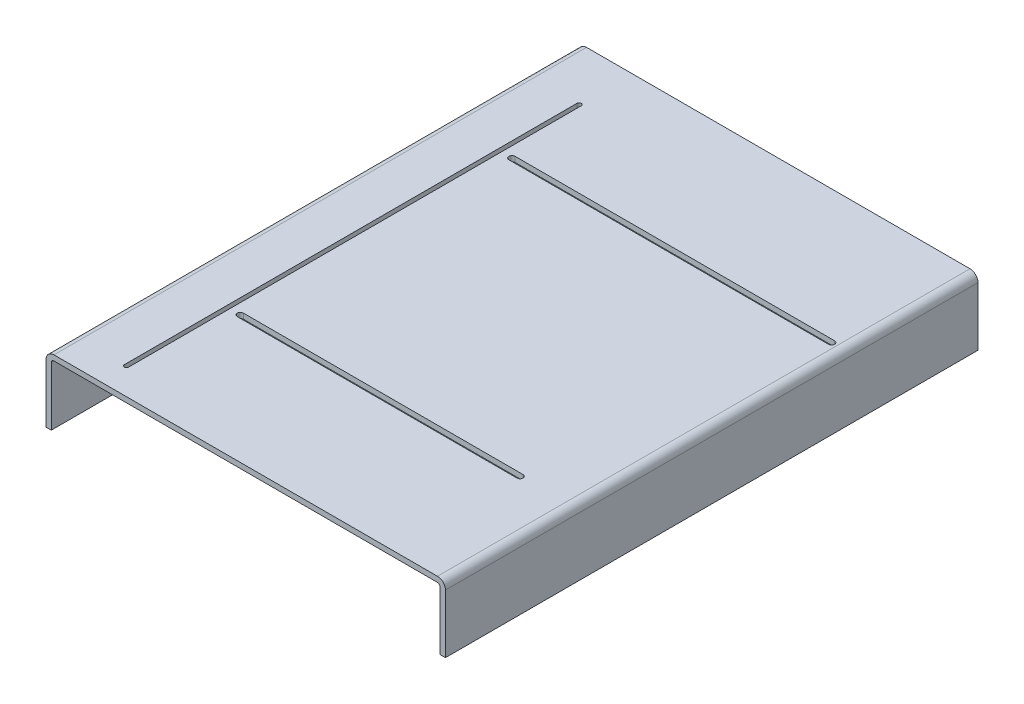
ISO-10303-21;
HEADER;
FILE_DESCRIPTION(('STEP AP214'),'2;1');
FILE_NAME('part.step','',(''),(''),'','','');
FILE_SCHEMA(('AUTOMOTIVE_DESIGN { 1 0 10303 214 1 1 1 1 }'));
ENDSEC;
DATA;
#1=APPLICATION_CONTEXT('core data for automotive mechanical design processes');
#2=APPLICATION_PROTOCOL_DEFINITION('international standard','automotive_design',2000,#1);
#3=PRODUCT_CONTEXT('',#1,'mechanical');
#4=PRODUCT('Part','Part','',(#3));
#5=PRODUCT_RELATED_PRODUCT_CATEGORY('part','',(#4));
#6=PRODUCT_DEFINITION_FORMATION('','',#4);
#7=PRODUCT_DEFINITION_CONTEXT('part definition',#1,'design');
#8=PRODUCT_DEFINITION('design','',#6,#7);
#9=PRODUCT_DEFINITION_SHAPE('','',#8);
#10=(LENGTH_UNIT() NAMED_UNIT(*) SI_UNIT(.MILLI.,.METRE.));
#11=(NAMED_UNIT(*) PLANE_ANGLE_UNIT() SI_UNIT($,.RADIAN.));
#12=(NAMED_UNIT(*) SI_UNIT($,.STERADIAN.) SOLID_ANGLE_UNIT());
#13=UNCERTAINTY_MEASURE_WITH_UNIT(LENGTH_MEASURE(1.E-05),#10,'distance_accuracy_value','');
#14=(GEOMETRIC_REPRESENTATION_CONTEXT(3) GLOBAL_UNCERTAINTY_ASSIGNED_CONTEXT((#13)) GLOBAL_UNIT_ASSIGNED_CONTEXT((#10,
#11,#12)) REPRESENTATION_CONTEXT('',''));
#15=CARTESIAN_POINT('',(0.,0.,0.));
#16=DIRECTION('',(0.,0.,1.));
#17=DIRECTION('',(1.,0.,0.));
#18=AXIS2_PLACEMENT_3D('',#15,#16,#17);
#19=CARTESIAN_POINT('',(10.,0.,1000.));
#20=DIRECTION('',(0.,1.,0.));
#21=DIRECTION('',(0.,0.,1.));
#22=AXIS2_PLACEMENT_3D('',#19,#20,#21);
#23=PLANE('',#22);
#24=DIRECTION('',(1.,0.,0.));
#25=VECTOR('',#24,1.);
#26=CARTESIAN_POINT('',(10.,0.,0.));
#27=LINE('',#26,#25);
#28=CARTESIAN_POINT('',(0.,0.,0.));
#29=VERTEX_POINT('',#28);
#30=CARTESIAN_POINT('',(10.,0.,0.));
#31=VERTEX_POINT('',#30);
#32=EDGE_CURVE('E288',#29,#31,#27,.T.);
#33=ORIENTED_EDGE('',*,*,#32,.T.);
#34=DIRECTION('',(0.,0.,-1.));
#35=VECTOR('',#34,1.);
#36=CARTESIAN_POINT('',(10.,0.,1000.));
#37=LINE('',#36,#35);
#38=CARTESIAN_POINT('',(10.,0.,1000.));
#39=VERTEX_POINT('',#38);
#40=EDGE_CURVE('E339',#39,#31,#37,.T.);
#41=ORIENTED_EDGE('',*,*,#40,.F.);
#42=DIRECTION('',(1.,0.,0.));
#43=VECTOR('',#42,1.);
#44=CARTESIAN_POINT('',(10.,0.,1000.));
#45=LINE('',#44,#43);
#46=CARTESIAN_POINT('',(0.,0.,1000.));
#47=VERTEX_POINT('',#46);
#48=EDGE_CURVE('E289',#47,#39,#45,.T.);
#49=ORIENTED_EDGE('',*,*,#48,.F.);
#50=DIRECTION('',(0.,0.,-1.));
#51=VECTOR('',#50,1.);
#52=CARTESIAN_POINT('',(0.,0.,1000.));
#53=LINE('',#52,#51);
#54=EDGE_CURVE('E311',#47,#29,#53,.T.);
#55=ORIENTED_EDGE('',*,*,#54,.T.);
#56=EDGE_LOOP('',(#33,#41,#49,#55));
#57=FACE_BOUND('',#56,.T.);
#58=ADVANCED_FACE('F31',(#57),#23,.F.);
#59=CARTESIAN_POINT('',(10.,0.,1000.));
#60=DIRECTION('',(-1.,0.,0.));
#61=DIRECTION('',(0.,0.,1.));
#62=AXIS2_PLACEMENT_3D('',#59,#60,#61);
#63=PLANE('',#62);
#64=DIRECTION('',(0.,1.,0.));
#65=VECTOR('',#64,1.);
#66=CARTESIAN_POINT('',(10.,0.,0.));
#67=LINE('',#66,#65);
#68=CARTESIAN_POINT('',(10.,110.,0.));
#69=VERTEX_POINT('',#68);
#70=EDGE_CURVE('E314',#31,#69,#67,.T.);
#71=ORIENTED_EDGE('',*,*,#70,.T.);
#72=DIRECTION('',(0.,0.,-1.));
#73=VECTOR('',#72,1.);
#74=CARTESIAN_POINT('',(10.,110.,1000.));
#75=LINE('',#74,#73);
#76=CARTESIAN_POINT('',(10.,110.,1000.));
#77=VERTEX_POINT('',#76);
#78=EDGE_CURVE('E350',#69,#77,#75,.F.);
#79=ORIENTED_EDGE('',*,*,#78,.T.);
#80=DIRECTION('',(0.,1.,0.));
#81=VECTOR('',#80,1.);
#82=CARTESIAN_POINT('',(10.,0.,1000.));
#83=LINE('',#82,#81);
#84=EDGE_CURVE('E292',#39,#77,#83,.T.);
#85=ORIENTED_EDGE('',*,*,#84,.F.);
#86=ORIENTED_EDGE('',*,*,#40,.T.);
#87=EDGE_LOOP('',(#71,#79,#85,#86));
#88=FACE_BOUND('',#87,.T.);
#89=ADVANCED_FACE('F425',(#88),#63,.F.);
#90=CARTESIAN_POINT('',(10.,115.,1000.));
#91=DIRECTION('',(0.,1.,0.));
#92=DIRECTION('',(0.,0.,1.));
#93=AXIS2_PLACEMENT_3D('',#90,#91,#92);
#94=PLANE('',#93);
#95=DIRECTION('',(1.,0.,0.));
#96=VECTOR('',#95,1.);
#97=CARTESIAN_POINT('',(125.,115.,754.25));
#98=LINE('',#97,#96);
#99=CARTESIAN_POINT('',(125.,115.,754.25));
#100=VERTEX_POINT('',#99);
#101=CARTESIAN_POINT('',(650.,115.,754.25));
#102=VERTEX_POINT('',#101);
#103=EDGE_CURVE('E211',#100,#102,#98,.T.);
#104=ORIENTED_EDGE('',*,*,#103,.F.);
#105=CARTESIAN_POINT('',(125.,115.,760.));
#106=DIRECTION('',(0.,1.,0.));
#107=DIRECTION('',(0.,0.,1.));
#108=AXIS2_PLACEMENT_3D('',#105,#106,#107);
#109=CIRCLE('',#108,5.74999999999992);
#110=CARTESIAN_POINT('',(125.,115.,765.75));
#111=VERTEX_POINT('',#110);
#112=EDGE_CURVE('E193',#111,#100,#109,.F.);
#113=ORIENTED_EDGE('',*,*,#112,.F.);
#114=DIRECTION('',(-1.,0.,0.));
#115=VECTOR('',#114,1.);
#116=CARTESIAN_POINT('',(125.,115.,765.75));
#117=LINE('',#116,#115);
#118=CARTESIAN_POINT('',(650.,115.,765.75));
#119=VERTEX_POINT('',#118);
#120=EDGE_CURVE('E202',#119,#111,#117,.T.);
#121=ORIENTED_EDGE('',*,*,#120,.F.);
#122=CARTESIAN_POINT('',(650.,115.,760.));
#123=DIRECTION('',(0.,1.,0.));
#124=DIRECTION('',(0.,0.,1.));
#125=AXIS2_PLACEMENT_3D('',#122,#123,#124);
#126=CIRCLE('',#125,5.74999999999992);
#127=EDGE_CURVE('E46',#102,#119,#126,.F.);
#128=ORIENTED_EDGE('',*,*,#127,.F.);
#129=EDGE_LOOP('',(#104,#113,#121,#128));
#130=FACE_BOUND('',#129,.T.);
#131=DIRECTION('',(0.,0.,-1.));
#132=VECTOR('',#131,1.);
#133=CARTESIAN_POINT('',(105.,115.,1000.));
#134=LINE('',#133,#132);
#135=CARTESIAN_POINT('',(105.,115.,950.));
#136=VERTEX_POINT('',#135);
#137=CARTESIAN_POINT('',(105.,115.,100.));
#138=VERTEX_POINT('',#137);
#139=EDGE_CURVE('E253',#136,#138,#134,.T.);
#140=ORIENTED_EDGE('',*,*,#139,.T.);
#141=CARTESIAN_POINT('',(101.,115.,100.));
#142=DIRECTION('',(0.,1.,0.));
#143=DIRECTION('',(0.,0.,1.));
#144=AXIS2_PLACEMENT_3D('',#141,#142,#143);
#145=CIRCLE('',#144,3.99999999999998);
#146=CARTESIAN_POINT('',(97.,115.,100.));
#147=VERTEX_POINT('',#146);
#148=EDGE_CURVE('E256',#138,#147,#145,.T.);
#149=ORIENTED_EDGE('',*,*,#148,.T.);
#150=DIRECTION('',(0.,0.,1.));
#151=VECTOR('',#150,1.);
#152=CARTESIAN_POINT('',(97.0000000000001,115.,1000.));
#153=LINE('',#152,#151);
#154=CARTESIAN_POINT('',(97.0000000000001,115.,950.));
#155=VERTEX_POINT('',#154);
#156=EDGE_CURVE('E241',#147,#155,#153,.T.);
#157=ORIENTED_EDGE('',*,*,#156,.T.);
#158=CARTESIAN_POINT('',(101.,115.,950.));
#159=DIRECTION('',(0.,1.,0.));
#160=DIRECTION('',(0.,0.,1.));
#161=AXIS2_PLACEMENT_3D('',#158,#159,#160);
#162=CIRCLE('',#161,4.);
#163=EDGE_CURVE('E250',#155,#136,#162,.T.);
#164=ORIENTED_EDGE('',*,*,#163,.T.);
#165=EDGE_LOOP('',(#140,#149,#157,#164));
#166=FACE_BOUND('',#165,.T.);
#167=DIRECTION('',(1.,0.,0.));
#168=VECTOR('',#167,1.);
#169=CARTESIAN_POINT('',(125.,115.,244.25));
#170=LINE('',#169,#168);
#171=CARTESIAN_POINT('',(125.,115.,244.25));
#172=VERTEX_POINT('',#171);
#173=CARTESIAN_POINT('',(725.,115.,244.25));
#174=VERTEX_POINT('',#173);
#175=EDGE_CURVE('E263',#172,#174,#170,.T.);
#176=ORIENTED_EDGE('',*,*,#175,.F.);
#177=CARTESIAN_POINT('',(125.,115.,250.));
#178=DIRECTION('',(0.,1.,0.));
#179=DIRECTION('',(0.,0.,1.));
#180=AXIS2_PLACEMENT_3D('',#177,#178,#179);
#181=CIRCLE('',#180,5.75000000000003);
#182=CARTESIAN_POINT('',(125.,115.,255.75));
#183=VERTEX_POINT('',#182);
#184=EDGE_CURVE('E266',#183,#172,#181,.F.);
#185=ORIENTED_EDGE('',*,*,#184,.F.);
#186=DIRECTION('',(-1.,0.,0.));
#187=VECTOR('',#186,1.);
#188=CARTESIAN_POINT('',(125.,115.,255.75));
#189=LINE('',#188,#187);
#190=CARTESIAN_POINT('',(725.,115.,255.75));
#191=VERTEX_POINT('',#190);
#192=EDGE_CURVE('E268',#191,#183,#189,.T.);
#193=ORIENTED_EDGE('',*,*,#192,.F.);
#194=CARTESIAN_POINT('',(725.,115.,250.));
#195=DIRECTION('',(0.,1.,0.));
#196=DIRECTION('',(0.,0.,1.));
#197=AXIS2_PLACEMENT_3D('',#194,#195,#196);
#198=CIRCLE('',#197,5.74999999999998);
#199=EDGE_CURVE('E260',#174,#191,#198,.F.);
#200=ORIENTED_EDGE('',*,*,#199,.F.);
#201=EDGE_LOOP('',(#176,#185,#193,#200));
#202=FACE_BOUND('',#201,.T.);
#203=DIRECTION('',(1.,0.,0.));
#204=VECTOR('',#203,1.);
#205=CARTESIAN_POINT('',(10.,115.,0.));
#206=LINE('',#205,#204);
#207=CARTESIAN_POINT('',(15.,115.,0.));
#208=VERTEX_POINT('',#207);
#209=CARTESIAN_POINT('',(735.,115.,0.));
#210=VERTEX_POINT('',#209);
#211=EDGE_CURVE('E317',#208,#210,#206,.T.);
#212=ORIENTED_EDGE('',*,*,#211,.T.);
#213=DIRECTION('',(0.,0.,-1.));
#214=VECTOR('',#213,1.);
#215=CARTESIAN_POINT('',(735.,115.,1000.));
#216=LINE('',#215,#214);
#217=CARTESIAN_POINT('',(735.,115.,1000.));
#218=VERTEX_POINT('',#217);
#219=EDGE_CURVE('E348',#210,#218,#216,.F.);
#220=ORIENTED_EDGE('',*,*,#219,.T.);
#221=DIRECTION('',(1.,0.,0.));
#222=VECTOR('',#221,1.);
#223=CARTESIAN_POINT('',(10.,115.,1000.));
#224=LINE('',#223,#222);
#225=CARTESIAN_POINT('',(15.,115.,1000.));
#226=VERTEX_POINT('',#225);
#227=EDGE_CURVE('E296',#226,#218,#224,.T.);
#228=ORIENTED_EDGE('',*,*,#227,.F.);
#229=DIRECTION('',(0.,0.,-1.));
#230=VECTOR('',#229,1.);
#231=CARTESIAN_POINT('',(15.,115.,0.));
#232=LINE('',#231,#230);
#233=EDGE_CURVE('E345',#226,#208,#232,.T.);
#234=ORIENTED_EDGE('',*,*,#233,.T.);
#235=EDGE_LOOP('',(#212,#220,#228,#234));
#236=FACE_BOUND('',#235,.T.);
#237=ADVANCED_FACE('F208',(#130,#166,#202,#236),#94,.F.);
#238=CARTESIAN_POINT('',(740.,115.,1000.));
#239=DIRECTION('',(1.,0.,0.));
#240=DIRECTION('',(0.,0.,-1.));
#241=AXIS2_PLACEMENT_3D('',#238,#239,#240);
#242=PLANE('',#241);
#243=DIRECTION('',(0.,-1.,0.));
#244=VECTOR('',#243,1.);
#245=CARTESIAN_POINT('',(740.,115.,1000.));
#246=LINE('',#245,#244);
#247=CARTESIAN_POINT('',(740.,110.,1000.));
#248=VERTEX_POINT('',#247);
#249=CARTESIAN_POINT('',(740.,0.,1000.));
#250=VERTEX_POINT('',#249);
#251=EDGE_CURVE('E299',#248,#250,#246,.T.);
#252=ORIENTED_EDGE('',*,*,#251,.F.);
#253=DIRECTION('',(0.,0.,-1.));
#254=VECTOR('',#253,1.);
#255=CARTESIAN_POINT('',(740.,110.,0.));
#256=LINE('',#255,#254);
#257=CARTESIAN_POINT('',(740.,110.,0.));
#258=VERTEX_POINT('',#257);
#259=EDGE_CURVE('E342',#248,#258,#256,.T.);
#260=ORIENTED_EDGE('',*,*,#259,.T.);
#261=DIRECTION('',(0.,-1.,0.));
#262=VECTOR('',#261,1.);
#263=CARTESIAN_POINT('',(740.,115.,0.));
#264=LINE('',#263,#262);
#265=CARTESIAN_POINT('',(740.,0.,0.));
#266=VERTEX_POINT('',#265);
#267=EDGE_CURVE('E320',#258,#266,#264,.T.);
#268=ORIENTED_EDGE('',*,*,#267,.T.);
#269=DIRECTION('',(0.,0.,-1.));
#270=VECTOR('',#269,1.);
#271=CARTESIAN_POINT('',(740.,0.,1000.));
#272=LINE('',#271,#270);
#273=EDGE_CURVE('E336',#250,#266,#272,.T.);
#274=ORIENTED_EDGE('',*,*,#273,.F.);
#275=EDGE_LOOP('',(#252,#260,#268,#274));
#276=FACE_BOUND('',#275,.T.);
#277=ADVANCED_FACE('F411',(#276),#242,.F.);
#278=CARTESIAN_POINT('',(740.,0.,1000.));
#279=DIRECTION('',(0.,1.,0.));
#280=DIRECTION('',(0.,0.,1.));
#281=AXIS2_PLACEMENT_3D('',#278,#279,#280);
#282=PLANE('',#281);
#283=DIRECTION('',(1.,0.,0.));
#284=VECTOR('',#283,1.);
#285=CARTESIAN_POINT('',(740.,0.,0.));
#286=LINE('',#285,#284);
#287=CARTESIAN_POINT('',(750.,0.,0.));
#288=VERTEX_POINT('',#287);
#289=EDGE_CURVE('E322',#266,#288,#286,.T.);
#290=ORIENTED_EDGE('',*,*,#289,.T.);
#291=DIRECTION('',(0.,0.,-1.));
#292=VECTOR('',#291,1.);
#293=CARTESIAN_POINT('',(750.,0.,1000.));
#294=LINE('',#293,#292);
#295=CARTESIAN_POINT('',(750.,0.,1000.));
#296=VERTEX_POINT('',#295);
#297=EDGE_CURVE('E333',#296,#288,#294,.T.);
#298=ORIENTED_EDGE('',*,*,#297,.F.);
#299=DIRECTION('',(1.,0.,0.));
#300=VECTOR('',#299,1.);
#301=CARTESIAN_POINT('',(740.,0.,1000.));
#302=LINE('',#301,#300);
#303=EDGE_CURVE('E301',#250,#296,#302,.T.);
#304=ORIENTED_EDGE('',*,*,#303,.F.);
#305=ORIENTED_EDGE('',*,*,#273,.T.);
#306=EDGE_LOOP('',(#290,#298,#304,#305));
#307=FACE_BOUND('',#306,.T.);
#308=ADVANCED_FACE('F405',(#307),#282,.F.);
#309=CARTESIAN_POINT('',(750.,125.,1000.));
#310=DIRECTION('',(-1.,0.,0.));
#311=DIRECTION('',(0.,0.,1.));
#312=AXIS2_PLACEMENT_3D('',#309,#310,#311);
#313=PLANE('',#312);
#314=DIRECTION('',(0.,1.,0.));
#315=VECTOR('',#314,1.);
#316=CARTESIAN_POINT('',(750.,125.,0.));
#317=LINE('',#316,#315);
#318=CARTESIAN_POINT('',(750.,110.,0.));
#319=VERTEX_POINT('',#318);
#320=EDGE_CURVE('E324',#288,#319,#317,.T.);
#321=ORIENTED_EDGE('',*,*,#320,.T.);
#322=DIRECTION('',(0.,0.,-1.));
#323=VECTOR('',#322,1.);
#324=CARTESIAN_POINT('',(750.,110.,1000.));
#325=LINE('',#324,#323);
#326=CARTESIAN_POINT('',(750.,110.,1000.));
#327=VERTEX_POINT('',#326);
#328=EDGE_CURVE('E11',#319,#327,#325,.F.);
#329=ORIENTED_EDGE('',*,*,#328,.T.);
#330=DIRECTION('',(0.,1.,0.));
#331=VECTOR('',#330,1.);
#332=CARTESIAN_POINT('',(750.,125.,1000.));
#333=LINE('',#332,#331);
#334=EDGE_CURVE('E303',#296,#327,#333,.T.);
#335=ORIENTED_EDGE('',*,*,#334,.F.);
#336=ORIENTED_EDGE('',*,*,#297,.T.);
#337=EDGE_LOOP('',(#321,#329,#335,#336));
#338=FACE_BOUND('',#337,.T.);
#339=ADVANCED_FACE('F400',(#338),#313,.F.);
#340=CARTESIAN_POINT('',(0.,125.,1000.));
#341=DIRECTION('',(0.,-1.,0.));
#342=DIRECTION('',(0.,0.,-1.));
#343=AXIS2_PLACEMENT_3D('',#340,#341,#342);
#344=PLANE('',#343);
#345=DIRECTION('',(1.,0.,0.));
#346=VECTOR('',#345,1.);
#347=CARTESIAN_POINT('',(125.,125.,765.75));
#348=LINE('',#347,#346);
#349=CARTESIAN_POINT('',(125.,125.,765.75));
#350=VERTEX_POINT('',#349);
#351=CARTESIAN_POINT('',(650.,125.,765.75));
#352=VERTEX_POINT('',#351);
#353=EDGE_CURVE('E213',#350,#352,#348,.T.);
#354=ORIENTED_EDGE('',*,*,#353,.F.);
#355=CARTESIAN_POINT('',(125.,125.,760.));
#356=DIRECTION('',(0.,1.,0.));
#357=DIRECTION('',(0.,0.,1.));
#358=AXIS2_PLACEMENT_3D('',#355,#356,#357);
#359=CIRCLE('',#358,5.74999999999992);
#360=CARTESIAN_POINT('',(125.,125.,754.25));
#361=VERTEX_POINT('',#360);
#362=EDGE_CURVE('E54',#361,#350,#359,.T.);
#363=ORIENTED_EDGE('',*,*,#362,.F.);
#364=DIRECTION('',(-1.,0.,0.));
#365=VECTOR('',#364,1.);
#366=CARTESIAN_POINT('',(125.,125.,754.25));
#367=LINE('',#366,#365);
#368=CARTESIAN_POINT('',(650.,125.,754.25));
#369=VERTEX_POINT('',#368);
#370=EDGE_CURVE('E199',#369,#361,#367,.T.);
#371=ORIENTED_EDGE('',*,*,#370,.F.);
#372=CARTESIAN_POINT('',(650.,125.,760.));
#373=DIRECTION('',(0.,1.,0.));
#374=DIRECTION('',(0.,0.,1.));
#375=AXIS2_PLACEMENT_3D('',#372,#373,#374);
#376=CIRCLE('',#375,5.74999999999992);
#377=EDGE_CURVE('E219',#352,#369,#376,.T.);
#378=ORIENTED_EDGE('',*,*,#377,.F.);
#379=EDGE_LOOP('',(#354,#363,#371,#378));
#380=FACE_BOUND('',#379,.T.);
#381=DIRECTION('',(0.,0.,1.));
#382=VECTOR('',#381,1.);
#383=CARTESIAN_POINT('',(97.,125.,100.));
#384=LINE('',#383,#382);
#385=CARTESIAN_POINT('',(97.,125.,100.));
#386=VERTEX_POINT('',#385);
#387=CARTESIAN_POINT('',(97.0000000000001,125.,950.));
#388=VERTEX_POINT('',#387);
#389=EDGE_CURVE('E229',#386,#388,#384,.T.);
#390=ORIENTED_EDGE('',*,*,#389,.F.);
#391=CARTESIAN_POINT('',(101.,125.,100.));
#392=DIRECTION('',(0.,1.,0.));
#393=DIRECTION('',(0.,0.,1.));
#394=AXIS2_PLACEMENT_3D('',#391,#392,#393);
#395=CIRCLE('',#394,3.99999999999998);
#396=CARTESIAN_POINT('',(105.,125.,100.));
#397=VERTEX_POINT('',#396);
#398=EDGE_CURVE('E205',#397,#386,#395,.T.);
#399=ORIENTED_EDGE('',*,*,#398,.F.);
#400=DIRECTION('',(0.,0.,-1.));
#401=VECTOR('',#400,1.);
#402=CARTESIAN_POINT('',(105.,125.,100.));
#403=LINE('',#402,#401);
#404=CARTESIAN_POINT('',(105.,125.,950.));
#405=VERTEX_POINT('',#404);
#406=EDGE_CURVE('E235',#405,#397,#403,.T.);
#407=ORIENTED_EDGE('',*,*,#406,.F.);
#408=CARTESIAN_POINT('',(101.,125.,950.));
#409=DIRECTION('',(0.,1.,0.));
#410=DIRECTION('',(0.,0.,1.));
#411=AXIS2_PLACEMENT_3D('',#408,#409,#410);
#412=CIRCLE('',#411,4.);
#413=EDGE_CURVE('E232',#388,#405,#412,.T.);
#414=ORIENTED_EDGE('',*,*,#413,.F.);
#415=EDGE_LOOP('',(#390,#399,#407,#414));
#416=FACE_BOUND('',#415,.T.);
#417=DIRECTION('',(1.,0.,0.));
#418=VECTOR('',#417,1.);
#419=CARTESIAN_POINT('',(125.,125.,255.75));
#420=LINE('',#419,#418);
#421=CARTESIAN_POINT('',(125.,125.,255.75));
#422=VERTEX_POINT('',#421);
#423=CARTESIAN_POINT('',(725.,125.,255.75));
#424=VERTEX_POINT('',#423);
#425=EDGE_CURVE('E270',#422,#424,#420,.T.);
#426=ORIENTED_EDGE('',*,*,#425,.F.);
#427=CARTESIAN_POINT('',(125.,125.,250.));
#428=DIRECTION('',(0.,1.,0.));
#429=DIRECTION('',(0.,0.,-1.));
#430=AXIS2_PLACEMENT_3D('',#427,#428,#429);
#431=CIRCLE('',#430,5.75000000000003);
#432=CARTESIAN_POINT('',(125.,125.,244.25));
#433=VERTEX_POINT('',#432);
#434=EDGE_CURVE('E259',#433,#422,#431,.T.);
#435=ORIENTED_EDGE('',*,*,#434,.F.);
#436=DIRECTION('',(-1.,0.,0.));
#437=VECTOR('',#436,1.);
#438=CARTESIAN_POINT('',(125.,125.,244.25));
#439=LINE('',#438,#437);
#440=CARTESIAN_POINT('',(725.,125.,244.25));
#441=VERTEX_POINT('',#440);
#442=EDGE_CURVE('E276',#441,#433,#439,.T.);
#443=ORIENTED_EDGE('',*,*,#442,.F.);
#444=CARTESIAN_POINT('',(725.,125.,250.));
#445=DIRECTION('',(0.,1.,0.));
#446=DIRECTION('',(0.,0.,-1.));
#447=AXIS2_PLACEMENT_3D('',#444,#445,#446);
#448=CIRCLE('',#447,5.74999999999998);
#449=EDGE_CURVE('E273',#424,#441,#448,.T.);
#450=ORIENTED_EDGE('',*,*,#449,.F.);
#451=EDGE_LOOP('',(#426,#435,#443,#450));
#452=FACE_BOUND('',#451,.T.);
#453=DIRECTION('',(-1.,0.,0.));
#454=VECTOR('',#453,1.);
#455=CARTESIAN_POINT('',(0.,125.,0.));
#456=LINE('',#455,#454);
#457=CARTESIAN_POINT('',(735.,125.,0.));
#458=VERTEX_POINT('',#457);
#459=CARTESIAN_POINT('',(15.,125.,0.));
#460=VERTEX_POINT('',#459);
#461=EDGE_CURVE('E327',#458,#460,#456,.T.);
#462=ORIENTED_EDGE('',*,*,#461,.T.);
#463=DIRECTION('',(0.,0.,-1.));
#464=VECTOR('',#463,1.);
#465=CARTESIAN_POINT('',(15.,125.,1000.));
#466=LINE('',#465,#464);
#467=CARTESIAN_POINT('',(15.,125.,1000.));
#468=VERTEX_POINT('',#467);
#469=EDGE_CURVE('E370',#460,#468,#466,.F.);
#470=ORIENTED_EDGE('',*,*,#469,.T.);
#471=DIRECTION('',(-1.,0.,0.));
#472=VECTOR('',#471,1.);
#473=CARTESIAN_POINT('',(0.,125.,1000.));
#474=LINE('',#473,#472);
#475=CARTESIAN_POINT('',(735.,125.,1000.));
#476=VERTEX_POINT('',#475);
#477=EDGE_CURVE('E306',#476,#468,#474,.T.);
#478=ORIENTED_EDGE('',*,*,#477,.F.);
#479=DIRECTION('',(0.,0.,-1.));
#480=VECTOR('',#479,1.);
#481=CARTESIAN_POINT('',(735.,125.,1000.));
#482=LINE('',#481,#480);
#483=EDGE_CURVE('E367',#476,#458,#482,.T.);
#484=ORIENTED_EDGE('',*,*,#483,.T.);
#485=EDGE_LOOP('',(#462,#470,#478,#484));
#486=FACE_BOUND('',#485,.T.);
#487=ADVANCED_FACE('F392',(#380,#416,#452,#486),#344,.F.);
#488=CARTESIAN_POINT('',(0.,0.,1000.));
#489=DIRECTION('',(1.,0.,0.));
#490=DIRECTION('',(0.,0.,-1.));
#491=AXIS2_PLACEMENT_3D('',#488,#489,#490);
#492=PLANE('',#491);
#493=DIRECTION('',(0.,-1.,0.));
#494=VECTOR('',#493,1.);
#495=CARTESIAN_POINT('',(0.,0.,1000.));
#496=LINE('',#495,#494);
#497=CARTESIAN_POINT('',(0.,110.,1000.));
#498=VERTEX_POINT('',#497);
#499=EDGE_CURVE('E309',#498,#47,#496,.T.);
#500=ORIENTED_EDGE('',*,*,#499,.F.);
#501=DIRECTION('',(0.,0.,-1.));
#502=VECTOR('',#501,1.);
#503=CARTESIAN_POINT('',(0.,110.,1000.));
#504=LINE('',#503,#502);
#505=CARTESIAN_POINT('',(0.,110.,0.));
#506=VERTEX_POINT('',#505);
#507=EDGE_CURVE('E360',#498,#506,#504,.T.);
#508=ORIENTED_EDGE('',*,*,#507,.T.);
#509=DIRECTION('',(0.,-1.,0.));
#510=VECTOR('',#509,1.);
#511=CARTESIAN_POINT('',(0.,0.,0.));
#512=LINE('',#511,#510);
#513=EDGE_CURVE('E293',#506,#29,#512,.T.);
#514=ORIENTED_EDGE('',*,*,#513,.T.);
#515=ORIENTED_EDGE('',*,*,#54,.F.);
#516=EDGE_LOOP('',(#500,#508,#514,#515));
#517=FACE_BOUND('',#516,.T.);
#518=ADVANCED_FACE('F383',(#517),#492,.F.);
#519=CARTESIAN_POINT('',(0.,0.,1000.));
#520=DIRECTION('',(0.,0.,-1.));
#521=DIRECTION('',(-1.,0.,0.));
#522=AXIS2_PLACEMENT_3D('',#519,#520,#521);
#523=PLANE('',#522);
#524=ORIENTED_EDGE('',*,*,#477,.T.);
#525=CARTESIAN_POINT('',(15.,110.,1000.));
#526=DIRECTION('',(0.,0.,-1.));
#527=DIRECTION('',(-1.,0.,0.));
#528=AXIS2_PLACEMENT_3D('',#525,#526,#527);
#529=CIRCLE('',#528,15.);
#530=EDGE_CURVE('E39',#468,#498,#529,.F.);
#531=ORIENTED_EDGE('',*,*,#530,.T.);
#532=ORIENTED_EDGE('',*,*,#499,.T.);
#533=ORIENTED_EDGE('',*,*,#48,.T.);
#534=ORIENTED_EDGE('',*,*,#84,.T.);
#535=CARTESIAN_POINT('',(15.,110.,1000.));
#536=DIRECTION('',(0.,0.,-1.));
#537=DIRECTION('',(-1.,0.,0.));
#538=AXIS2_PLACEMENT_3D('',#535,#536,#537);
#539=CIRCLE('',#538,5.);
#540=EDGE_CURVE('E358',#77,#226,#539,.T.);
#541=ORIENTED_EDGE('',*,*,#540,.T.);
#542=ORIENTED_EDGE('',*,*,#227,.T.);
#543=CARTESIAN_POINT('',(735.,110.,1000.));
#544=DIRECTION('',(0.,0.,-1.));
#545=DIRECTION('',(-1.,0.,0.));
#546=AXIS2_PLACEMENT_3D('',#543,#544,#545);
#547=CIRCLE('',#546,5.);
#548=EDGE_CURVE('E354',#218,#248,#547,.T.);
#549=ORIENTED_EDGE('',*,*,#548,.T.);
#550=ORIENTED_EDGE('',*,*,#251,.T.);
#551=ORIENTED_EDGE('',*,*,#303,.T.);
#552=ORIENTED_EDGE('',*,*,#334,.T.);
#553=CARTESIAN_POINT('',(735.,110.,1000.));
#554=DIRECTION('',(0.,0.,-1.));
#555=DIRECTION('',(-1.,0.,0.));
#556=AXIS2_PLACEMENT_3D('',#553,#554,#555);
#557=CIRCLE('',#556,15.);
#558=EDGE_CURVE('E372',#327,#476,#557,.F.);
#559=ORIENTED_EDGE('',*,*,#558,.T.);
#560=EDGE_LOOP('',(#524,#531,#532,#533,#534,#541,#542,#549,#550,#551,#552,#559));
#561=FACE_BOUND('',#560,.T.);
#562=ADVANCED_FACE('F376',(#561),#523,.F.);
#563=CARTESIAN_POINT('',(0.,0.,0.));
#564=DIRECTION('',(0.,0.,-1.));
#565=DIRECTION('',(-1.,0.,0.));
#566=AXIS2_PLACEMENT_3D('',#563,#564,#565);
#567=PLANE('',#566);
#568=ORIENTED_EDGE('',*,*,#513,.F.);
#569=CARTESIAN_POINT('',(15.,110.,0.));
#570=DIRECTION('',(0.,0.,-1.));
#571=DIRECTION('',(-1.,0.,0.));
#572=AXIS2_PLACEMENT_3D('',#569,#570,#571);
#573=CIRCLE('',#572,15.);
#574=EDGE_CURVE('E365',#506,#460,#573,.T.);
#575=ORIENTED_EDGE('',*,*,#574,.T.);
#576=ORIENTED_EDGE('',*,*,#461,.F.);
#577=CARTESIAN_POINT('',(735.,110.,0.));
#578=DIRECTION('',(0.,0.,-1.));
#579=DIRECTION('',(-1.,0.,0.));
#580=AXIS2_PLACEMENT_3D('',#577,#578,#579);
#581=CIRCLE('',#580,15.);
#582=EDGE_CURVE('E363',#458,#319,#581,.T.);
#583=ORIENTED_EDGE('',*,*,#582,.T.);
#584=ORIENTED_EDGE('',*,*,#320,.F.);
#585=ORIENTED_EDGE('',*,*,#289,.F.);
#586=ORIENTED_EDGE('',*,*,#267,.F.);
#587=CARTESIAN_POINT('',(735.,110.,0.));
#588=DIRECTION('',(0.,0.,-1.));
#589=DIRECTION('',(-1.,0.,0.));
#590=AXIS2_PLACEMENT_3D('',#587,#588,#589);
#591=CIRCLE('',#590,5.);
#592=EDGE_CURVE('E352',#258,#210,#591,.F.);
#593=ORIENTED_EDGE('',*,*,#592,.T.);
#594=ORIENTED_EDGE('',*,*,#211,.F.);
#595=CARTESIAN_POINT('',(15.,110.,0.));
#596=DIRECTION('',(0.,0.,-1.));
#597=DIRECTION('',(-1.,0.,0.));
#598=AXIS2_PLACEMENT_3D('',#595,#596,#597);
#599=CIRCLE('',#598,5.);
#600=EDGE_CURVE('E356',#208,#69,#599,.F.);
#601=ORIENTED_EDGE('',*,*,#600,.T.);
#602=ORIENTED_EDGE('',*,*,#70,.F.);
#603=ORIENTED_EDGE('',*,*,#32,.F.);
#604=EDGE_LOOP('',(#568,#575,#576,#583,#584,#585,#586,#593,#594,#601,#602,#603));
#605=FACE_BOUND('',#604,.T.);
#606=ADVANCED_FACE('F389',(#605),#567,.T.);
#607=CARTESIAN_POINT('',(735.,110.,1000.));
#608=DIRECTION('',(0.,0.,1.));
#609=DIRECTION('',(1.,0.,0.));
#610=AXIS2_PLACEMENT_3D('',#607,#608,#609);
#611=CYLINDRICAL_SURFACE('',#610,5.);
#612=ORIENTED_EDGE('',*,*,#548,.F.);
#613=ORIENTED_EDGE('',*,*,#219,.F.);
#614=ORIENTED_EDGE('',*,*,#592,.F.);
#615=ORIENTED_EDGE('',*,*,#259,.F.);
#616=EDGE_LOOP('',(#612,#613,#614,#615));
#617=FACE_BOUND('',#616,.T.);
#618=ADVANCED_FACE('F415',(#617),#611,.F.);
#619=CARTESIAN_POINT('',(15.,110.,1000.));
#620=DIRECTION('',(0.,0.,1.));
#621=DIRECTION('',(1.,0.,0.));
#622=AXIS2_PLACEMENT_3D('',#619,#620,#621);
#623=CYLINDRICAL_SURFACE('',#622,5.);
#624=ORIENTED_EDGE('',*,*,#540,.F.);
#625=ORIENTED_EDGE('',*,*,#78,.F.);
#626=ORIENTED_EDGE('',*,*,#600,.F.);
#627=ORIENTED_EDGE('',*,*,#233,.F.);
#628=EDGE_LOOP('',(#624,#625,#626,#627));
#629=FACE_BOUND('',#628,.T.);
#630=ADVANCED_FACE('F423',(#629),#623,.F.);
#631=CARTESIAN_POINT('',(15.,110.,1000.));
#632=DIRECTION('',(0.,0.,-1.));
#633=DIRECTION('',(-1.,0.,0.));
#634=AXIS2_PLACEMENT_3D('',#631,#632,#633);
#635=CYLINDRICAL_SURFACE('',#634,15.);
#636=ORIENTED_EDGE('',*,*,#530,.F.);
#637=ORIENTED_EDGE('',*,*,#469,.F.);
#638=ORIENTED_EDGE('',*,*,#574,.F.);
#639=ORIENTED_EDGE('',*,*,#507,.F.);
#640=EDGE_LOOP('',(#636,#637,#638,#639));
#641=FACE_BOUND('',#640,.T.);
#642=ADVANCED_FACE('F386',(#641),#635,.T.);
#643=CARTESIAN_POINT('',(735.,110.,1000.));
#644=DIRECTION('',(0.,0.,-1.));
#645=DIRECTION('',(-1.,0.,0.));
#646=AXIS2_PLACEMENT_3D('',#643,#644,#645);
#647=CYLINDRICAL_SURFACE('',#646,15.);
#648=ORIENTED_EDGE('',*,*,#558,.F.);
#649=ORIENTED_EDGE('',*,*,#328,.F.);
#650=ORIENTED_EDGE('',*,*,#582,.F.);
#651=ORIENTED_EDGE('',*,*,#483,.F.);
#652=EDGE_LOOP('',(#648,#649,#650,#651));
#653=FACE_BOUND('',#652,.T.);
#654=ADVANCED_FACE('F33',(#653),#647,.T.);
#655=CARTESIAN_POINT('',(125.,-496.608126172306,250.));
#656=DIRECTION('',(0.,1.,0.));
#657=DIRECTION('',(0.,0.,1.));
#658=AXIS2_PLACEMENT_3D('',#655,#656,#657);
#659=CYLINDRICAL_SURFACE('',#658,5.75000000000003);
#660=ORIENTED_EDGE('',*,*,#184,.T.);
#661=DIRECTION('',(0.,1.,0.));
#662=VECTOR('',#661,1.);
#663=CARTESIAN_POINT('',(125.,-496.608126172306,244.25));
#664=LINE('',#663,#662);
#665=EDGE_CURVE('E264',#172,#433,#664,.T.);
#666=ORIENTED_EDGE('',*,*,#665,.T.);
#667=ORIENTED_EDGE('',*,*,#434,.T.);
#668=DIRECTION('',(0.,1.,0.));
#669=VECTOR('',#668,1.);
#670=CARTESIAN_POINT('',(125.,-496.608126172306,255.75));
#671=LINE('',#670,#669);
#672=EDGE_CURVE('E279',#183,#422,#671,.T.);
#673=ORIENTED_EDGE('',*,*,#672,.F.);
#674=EDGE_LOOP('',(#660,#666,#667,#673));
#675=FACE_BOUND('',#674,.T.);
#676=ADVANCED_FACE('F443',(#675),#659,.F.);
#677=CARTESIAN_POINT('',(125.,-496.608126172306,244.25));
#678=DIRECTION('',(0.,0.,-1.));
#679=DIRECTION('',(-1.,0.,0.));
#680=AXIS2_PLACEMENT_3D('',#677,#678,#679);
#681=PLANE('',#680);
#682=ORIENTED_EDGE('',*,*,#175,.T.);
#683=DIRECTION('',(0.,1.,0.));
#684=VECTOR('',#683,1.);
#685=CARTESIAN_POINT('',(725.,-496.608126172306,244.25));
#686=LINE('',#685,#684);
#687=EDGE_CURVE('E281',#174,#441,#686,.T.);
#688=ORIENTED_EDGE('',*,*,#687,.T.);
#689=ORIENTED_EDGE('',*,*,#442,.T.);
#690=ORIENTED_EDGE('',*,*,#665,.F.);
#691=EDGE_LOOP('',(#682,#688,#689,#690));
#692=FACE_BOUND('',#691,.T.);
#693=ADVANCED_FACE('F447',(#692),#681,.F.);
#694=CARTESIAN_POINT('',(725.,-496.608126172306,250.));
#695=DIRECTION('',(0.,1.,0.));
#696=DIRECTION('',(0.,0.,1.));
#697=AXIS2_PLACEMENT_3D('',#694,#695,#696);
#698=CYLINDRICAL_SURFACE('',#697,5.74999999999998);
#699=ORIENTED_EDGE('',*,*,#199,.T.);
#700=DIRECTION('',(0.,1.,0.));
#701=VECTOR('',#700,1.);
#702=CARTESIAN_POINT('',(725.,-496.608126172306,255.75));
#703=LINE('',#702,#701);
#704=EDGE_CURVE('E283',#191,#424,#703,.T.);
#705=ORIENTED_EDGE('',*,*,#704,.T.);
#706=ORIENTED_EDGE('',*,*,#449,.T.);
#707=ORIENTED_EDGE('',*,*,#687,.F.);
#708=EDGE_LOOP('',(#699,#705,#706,#707));
#709=FACE_BOUND('',#708,.T.);
#710=ADVANCED_FACE('F453',(#709),#698,.F.);
#711=CARTESIAN_POINT('',(125.,-496.608126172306,255.75));
#712=DIRECTION('',(0.,0.,1.));
#713=DIRECTION('',(1.,0.,0.));
#714=AXIS2_PLACEMENT_3D('',#711,#712,#713);
#715=PLANE('',#714);
#716=ORIENTED_EDGE('',*,*,#192,.T.);
#717=ORIENTED_EDGE('',*,*,#672,.T.);
#718=ORIENTED_EDGE('',*,*,#425,.T.);
#719=ORIENTED_EDGE('',*,*,#704,.F.);
#720=EDGE_LOOP('',(#716,#717,#718,#719));
#721=FACE_BOUND('',#720,.T.);
#722=ADVANCED_FACE('F458',(#721),#715,.F.);
#723=CARTESIAN_POINT('',(101.,0.,100.));
#724=DIRECTION('',(0.,1.,0.));
#725=DIRECTION('',(0.,0.,1.));
#726=AXIS2_PLACEMENT_3D('',#723,#724,#725);
#727=CYLINDRICAL_SURFACE('',#726,3.99999999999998);
#728=DIRECTION('',(0.,1.,0.));
#729=VECTOR('',#728,1.);
#730=CARTESIAN_POINT('',(105.,0.,100.));
#731=LINE('',#730,#729);
#732=EDGE_CURVE('E239',#138,#397,#731,.T.);
#733=ORIENTED_EDGE('',*,*,#732,.T.);
#734=ORIENTED_EDGE('',*,*,#398,.T.);
#735=DIRECTION('',(0.,1.,0.));
#736=VECTOR('',#735,1.);
#737=CARTESIAN_POINT('',(97.,0.,100.));
#738=LINE('',#737,#736);
#739=EDGE_CURVE('E238',#147,#386,#738,.T.);
#740=ORIENTED_EDGE('',*,*,#739,.F.);
#741=ORIENTED_EDGE('',*,*,#148,.F.);
#742=EDGE_LOOP('',(#733,#734,#740,#741));
#743=FACE_BOUND('',#742,.T.);
#744=ADVANCED_FACE('F553',(#743),#727,.F.);
#745=CARTESIAN_POINT('',(105.,0.,100.));
#746=DIRECTION('',(1.,0.,0.));
#747=DIRECTION('',(0.,0.,-1.));
#748=AXIS2_PLACEMENT_3D('',#745,#746,#747);
#749=PLANE('',#748);
#750=DIRECTION('',(0.,1.,0.));
#751=VECTOR('',#750,1.);
#752=CARTESIAN_POINT('',(105.,0.,950.));
#753=LINE('',#752,#751);
#754=EDGE_CURVE('E242',#136,#405,#753,.T.);
#755=ORIENTED_EDGE('',*,*,#754,.T.);
#756=ORIENTED_EDGE('',*,*,#406,.T.);
#757=ORIENTED_EDGE('',*,*,#732,.F.);
#758=ORIENTED_EDGE('',*,*,#139,.F.);
#759=EDGE_LOOP('',(#755,#756,#757,#758));
#760=FACE_BOUND('',#759,.T.);
#761=ADVANCED_FACE('F561',(#760),#749,.F.);
#762=CARTESIAN_POINT('',(101.,0.,950.));
#763=DIRECTION('',(0.,1.,0.));
#764=DIRECTION('',(0.,0.,1.));
#765=AXIS2_PLACEMENT_3D('',#762,#763,#764);
#766=CYLINDRICAL_SURFACE('',#765,4.);
#767=DIRECTION('',(0.,1.,0.));
#768=VECTOR('',#767,1.);
#769=CARTESIAN_POINT('',(97.0000000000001,0.,950.));
#770=LINE('',#769,#768);
#771=EDGE_CURVE('E244',#155,#388,#770,.T.);
#772=ORIENTED_EDGE('',*,*,#771,.T.);
#773=ORIENTED_EDGE('',*,*,#413,.T.);
#774=ORIENTED_EDGE('',*,*,#754,.F.);
#775=ORIENTED_EDGE('',*,*,#163,.F.);
#776=EDGE_LOOP('',(#772,#773,#774,#775));
#777=FACE_BOUND('',#776,.T.);
#778=ADVANCED_FACE('F570',(#777),#766,.F.);
#779=CARTESIAN_POINT('',(97.,0.,100.));
#780=DIRECTION('',(-1.,0.,0.));
#781=DIRECTION('',(0.,0.,1.));
#782=AXIS2_PLACEMENT_3D('',#779,#780,#781);
#783=PLANE('',#782);
#784=ORIENTED_EDGE('',*,*,#739,.T.);
#785=ORIENTED_EDGE('',*,*,#389,.T.);
#786=ORIENTED_EDGE('',*,*,#771,.F.);
#787=ORIENTED_EDGE('',*,*,#156,.F.);
#788=EDGE_LOOP('',(#784,#785,#786,#787));
#789=FACE_BOUND('',#788,.T.);
#790=ADVANCED_FACE('F579',(#789),#783,.F.);
#791=CARTESIAN_POINT('',(125.,-0.001000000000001,760.));
#792=DIRECTION('',(0.,1.,0.));
#793=DIRECTION('',(0.,0.,1.));
#794=AXIS2_PLACEMENT_3D('',#791,#792,#793);
#795=CYLINDRICAL_SURFACE('',#794,5.74999999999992);
#796=ORIENTED_EDGE('',*,*,#112,.T.);
#797=DIRECTION('',(0.,1.,0.));
#798=VECTOR('',#797,1.);
#799=CARTESIAN_POINT('',(125.,-0.001000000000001,754.25));
#800=LINE('',#799,#798);
#801=EDGE_CURVE('E206',#100,#361,#800,.T.);
#802=ORIENTED_EDGE('',*,*,#801,.T.);
#803=ORIENTED_EDGE('',*,*,#362,.T.);
#804=DIRECTION('',(0.,1.,0.));
#805=VECTOR('',#804,1.);
#806=CARTESIAN_POINT('',(125.,-0.001000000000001,765.75));
#807=LINE('',#806,#805);
#808=EDGE_CURVE('E189',#111,#350,#807,.T.);
#809=ORIENTED_EDGE('',*,*,#808,.F.);
#810=EDGE_LOOP('',(#796,#802,#803,#809));
#811=FACE_BOUND('',#810,.T.);
#812=ADVANCED_FACE('F191',(#811),#795,.F.);
#813=CARTESIAN_POINT('',(125.,-0.001000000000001,754.25));
#814=DIRECTION('',(0.,0.,-1.));
#815=DIRECTION('',(-1.,0.,0.));
#816=AXIS2_PLACEMENT_3D('',#813,#814,#815);
#817=PLANE('',#816);
#818=ORIENTED_EDGE('',*,*,#103,.T.);
#819=DIRECTION('',(0.,1.,0.));
#820=VECTOR('',#819,1.);
#821=CARTESIAN_POINT('',(650.,-0.001000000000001,754.25));
#822=LINE('',#821,#820);
#823=EDGE_CURVE('E225',#102,#369,#822,.T.);
#824=ORIENTED_EDGE('',*,*,#823,.T.);
#825=ORIENTED_EDGE('',*,*,#370,.T.);
#826=ORIENTED_EDGE('',*,*,#801,.F.);
#827=EDGE_LOOP('',(#818,#824,#825,#826));
#828=FACE_BOUND('',#827,.T.);
#829=ADVANCED_FACE('F594',(#828),#817,.F.);
#830=CARTESIAN_POINT('',(650.,-0.001000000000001,760.));
#831=DIRECTION('',(0.,1.,0.));
#832=DIRECTION('',(0.,0.,1.));
#833=AXIS2_PLACEMENT_3D('',#830,#831,#832);
#834=CYLINDRICAL_SURFACE('',#833,5.74999999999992);
#835=ORIENTED_EDGE('',*,*,#127,.T.);
#836=DIRECTION('',(0.,1.,0.));
#837=VECTOR('',#836,1.);
#838=CARTESIAN_POINT('',(650.,-0.001000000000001,765.75));
#839=LINE('',#838,#837);
#840=EDGE_CURVE('E198',#119,#352,#839,.T.);
#841=ORIENTED_EDGE('',*,*,#840,.T.);
#842=ORIENTED_EDGE('',*,*,#377,.T.);
#843=ORIENTED_EDGE('',*,*,#823,.F.);
#844=EDGE_LOOP('',(#835,#841,#842,#843));
#845=FACE_BOUND('',#844,.T.);
#846=ADVANCED_FACE('F602',(#845),#834,.F.);
#847=CARTESIAN_POINT('',(125.,-0.001000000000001,765.75));
#848=DIRECTION('',(0.,0.,1.));
#849=DIRECTION('',(1.,0.,0.));
#850=AXIS2_PLACEMENT_3D('',#847,#848,#849);
#851=PLANE('',#850);
#852=ORIENTED_EDGE('',*,*,#120,.T.);
#853=ORIENTED_EDGE('',*,*,#808,.T.);
#854=ORIENTED_EDGE('',*,*,#353,.T.);
#855=ORIENTED_EDGE('',*,*,#840,.F.);
#856=EDGE_LOOP('',(#852,#853,#854,#855));
#857=FACE_BOUND('',#856,.T.);
#858=ADVANCED_FACE('F203',(#857),#851,.F.);
#859=CLOSED_SHELL('',(#58,#89,#237,#277,#308,#339,#487,#518,#562,#606,#618,#630,#642,#654,#676,
#693,#710,#722,#744,#761,#778,#790,#812,#829,#846,#858));
#860=MANIFOLD_SOLID_BREP('B2',#859);
#861=ADVANCED_BREP_SHAPE_REPRESENTATION('',(#18,#860),#14);
#862=SHAPE_DEFINITION_REPRESENTATION(#9,#861);
ENDSEC;
END-ISO-10303-21;
